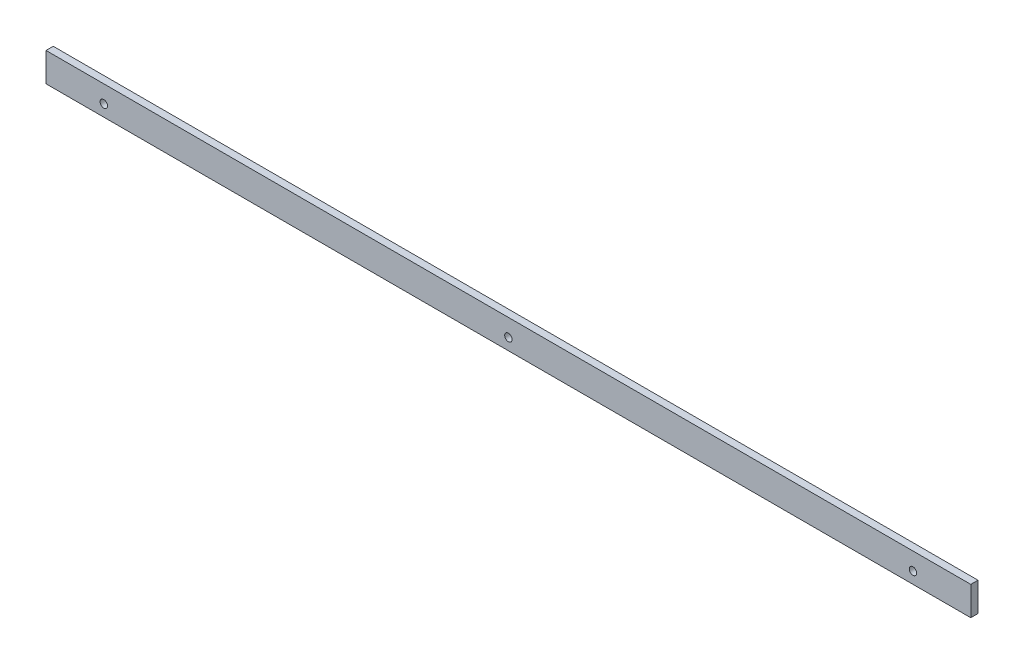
from build123d import *

# Parameters (mm, degrees)
SKETCH1_W             = 406.4
SKETCH1_H             = 12.7
BOSS_EXTRUDE1_DEPTH   = 3.175
F_4_CLEARANCE_HOLE1_D = 3.2639


with BuildPart() as part:
    # Sketch1 → Boss-Extrude1 (new body)
    with BuildSketch(Plane.XY):
        Rectangle(SKETCH1_W, SKETCH1_H)
    extrude(amount=BOSS_EXTRUDE1_DEPTH)

    # 4 Clearance Hole1 (through all)
    with Locations(Plane.XY.offset(3.175)):
        with Locations((-177.8, -1.27), (0, -1.27), (177.8, -1.27)):
            Hole(F_4_CLEARANCE_HOLE1_D / 2)


solid = part.part
